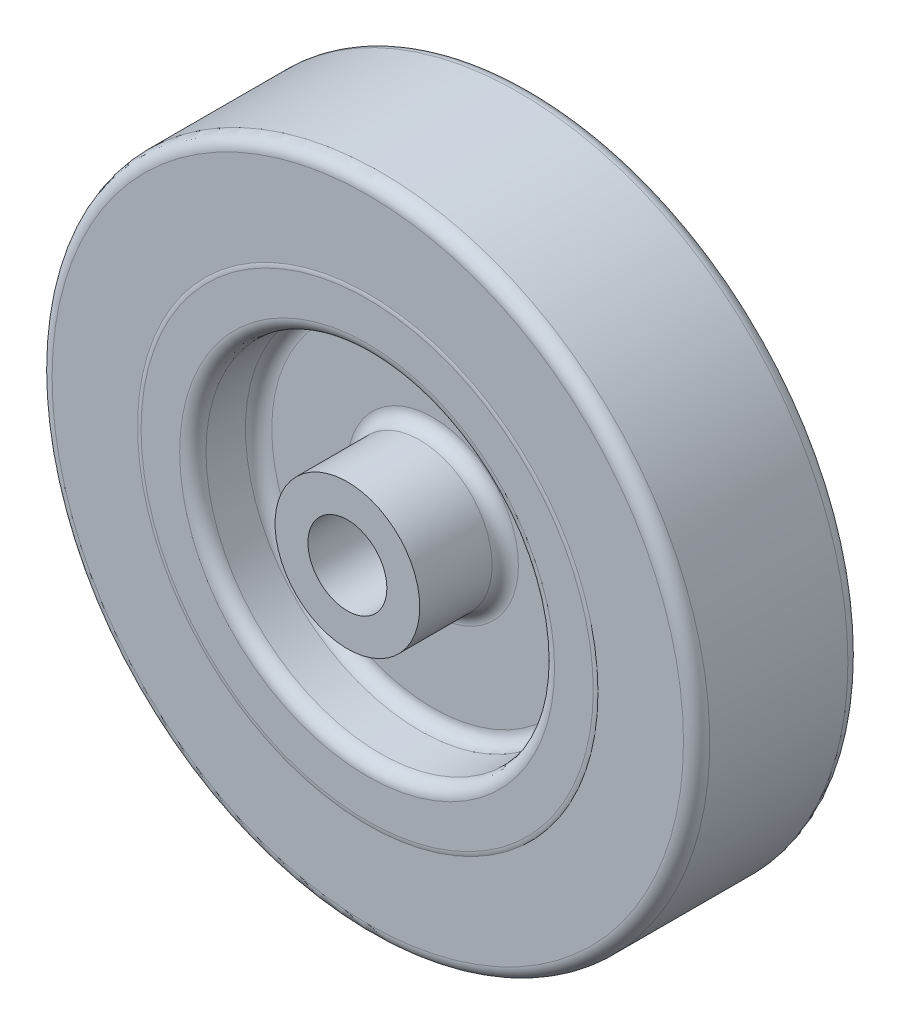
ISO-10303-21;
HEADER;
FILE_DESCRIPTION(('STEP AP214'),'2;1');
FILE_NAME('part.step','',(''),(''),'','','');
FILE_SCHEMA(('AUTOMOTIVE_DESIGN { 1 0 10303 214 1 1 1 1 }'));
ENDSEC;
DATA;
#1=APPLICATION_CONTEXT('core data for automotive mechanical design processes');
#2=APPLICATION_PROTOCOL_DEFINITION('international standard','automotive_design',2000,#1);
#3=PRODUCT_CONTEXT('',#1,'mechanical');
#4=PRODUCT('Part','Part','',(#3));
#5=PRODUCT_RELATED_PRODUCT_CATEGORY('part','',(#4));
#6=PRODUCT_DEFINITION_FORMATION('','',#4);
#7=PRODUCT_DEFINITION_CONTEXT('part definition',#1,'design');
#8=PRODUCT_DEFINITION('design','',#6,#7);
#9=PRODUCT_DEFINITION_SHAPE('','',#8);
#10=(LENGTH_UNIT() NAMED_UNIT(*) SI_UNIT(.MILLI.,.METRE.));
#11=(NAMED_UNIT(*) PLANE_ANGLE_UNIT() SI_UNIT($,.RADIAN.));
#12=(NAMED_UNIT(*) SI_UNIT($,.STERADIAN.) SOLID_ANGLE_UNIT());
#13=UNCERTAINTY_MEASURE_WITH_UNIT(LENGTH_MEASURE(1.E-05),#10,'distance_accuracy_value','');
#14=(GEOMETRIC_REPRESENTATION_CONTEXT(3) GLOBAL_UNCERTAINTY_ASSIGNED_CONTEXT((#13)) GLOBAL_UNIT_ASSIGNED_CONTEXT((#10,
#11,#12)) REPRESENTATION_CONTEXT('',''));
#15=CARTESIAN_POINT('',(0.,0.,0.));
#16=DIRECTION('',(0.,0.,1.));
#17=DIRECTION('',(1.,0.,0.));
#18=AXIS2_PLACEMENT_3D('',#15,#16,#17);
#19=CARTESIAN_POINT('',(-22.1248595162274,15.8933445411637,-3.1));
#20=DIRECTION('',(0.,0.,1.));
#21=DIRECTION('',(1.,0.,0.));
#22=AXIS2_PLACEMENT_3D('',#19,#20,#21);
#23=CYLINDRICAL_SURFACE('',#22,11.);
#24=CARTESIAN_POINT('',(-22.1248595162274,15.8933445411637,17.1));
#25=DIRECTION('',(0.,0.,1.));
#26=DIRECTION('',(1.,0.,0.));
#27=AXIS2_PLACEMENT_3D('',#24,#25,#26);
#28=CIRCLE('',#27,11.);
#29=CARTESIAN_POINT('',(-11.1248595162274,15.8933445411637,17.1));
#30=VERTEX_POINT('',#29);
#31=EDGE_CURVE('E185',#30,#30,#28,.T.);
#32=ORIENTED_EDGE('',*,*,#31,.T.);
#33=EDGE_LOOP('',(#32));
#34=FACE_BOUND('',#33,.T.);
#35=CARTESIAN_POINT('',(-22.1248595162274,15.8933445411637,28.1));
#36=DIRECTION('',(0.,0.,1.));
#37=DIRECTION('',(1.,0.,0.));
#38=AXIS2_PLACEMENT_3D('',#35,#36,#37);
#39=CIRCLE('',#38,11.);
#40=CARTESIAN_POINT('',(-11.1248595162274,15.8933445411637,28.1));
#41=VERTEX_POINT('',#40);
#42=EDGE_CURVE('E99',#41,#41,#39,.T.);
#43=ORIENTED_EDGE('',*,*,#42,.F.);
#44=EDGE_LOOP('',(#43));
#45=FACE_BOUND('',#44,.T.);
#46=ADVANCED_FACE('F16',(#34,#45),#23,.T.);
#47=CARTESIAN_POINT('',(-22.1248595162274,15.8933445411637,17.1));
#48=DIRECTION('',(0.,0.,1.));
#49=DIRECTION('',(1.,0.,0.));
#50=AXIS2_PLACEMENT_3D('',#47,#48,#49);
#51=TOROIDAL_SURFACE('',#50,13.,2.);
#52=ORIENTED_EDGE('',*,*,#31,.F.);
#53=EDGE_LOOP('',(#52));
#54=FACE_BOUND('',#53,.T.);
#55=CARTESIAN_POINT('',(-22.1248595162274,15.8933445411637,15.1));
#56=DIRECTION('',(0.,0.,1.));
#57=DIRECTION('',(-1.,0.,0.));
#58=AXIS2_PLACEMENT_3D('',#55,#56,#57);
#59=CIRCLE('',#58,13.);
#60=CARTESIAN_POINT('',(-9.12485951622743,15.8933445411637,15.1));
#61=VERTEX_POINT('',#60);
#62=CARTESIAN_POINT('',(-35.1248595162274,15.8933445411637,15.1));
#63=VERTEX_POINT('',#62);
#64=EDGE_CURVE('E87',#61,#63,#59,.F.);
#65=ORIENTED_EDGE('',*,*,#64,.F.);
#66=CARTESIAN_POINT('',(-22.1248595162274,15.8933445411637,15.1));
#67=DIRECTION('',(0.,0.,1.));
#68=DIRECTION('',(1.,0.,0.));
#69=AXIS2_PLACEMENT_3D('',#66,#67,#68);
#70=CIRCLE('',#69,13.);
#71=EDGE_CURVE('E90',#63,#61,#70,.F.);
#72=ORIENTED_EDGE('',*,*,#71,.F.);
#73=EDGE_LOOP('',(#65,#72));
#74=FACE_BOUND('',#73,.T.);
#75=ADVANCED_FACE('F98',(#54,#74),#51,.F.);
#76=CARTESIAN_POINT('',(-22.1248595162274,15.8933445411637,28.1));
#77=DIRECTION('',(0.,0.,1.));
#78=DIRECTION('',(1.,0.,0.));
#79=AXIS2_PLACEMENT_3D('',#76,#77,#78);
#80=PLANE('',#79);
#81=ORIENTED_EDGE('',*,*,#42,.T.);
#82=EDGE_LOOP('',(#81));
#83=FACE_BOUND('',#82,.T.);
#84=CARTESIAN_POINT('',(-22.1248595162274,15.8933445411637,28.1));
#85=DIRECTION('',(0.,0.,1.));
#86=DIRECTION('',(1.,0.,0.));
#87=AXIS2_PLACEMENT_3D('',#84,#85,#86);
#88=CIRCLE('',#87,6.);
#89=CARTESIAN_POINT('',(-16.1248595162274,15.8933445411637,28.1));
#90=VERTEX_POINT('',#89);
#91=EDGE_CURVE('E95',#90,#90,#88,.F.);
#92=ORIENTED_EDGE('',*,*,#91,.T.);
#93=EDGE_LOOP('',(#92));
#94=FACE_BOUND('',#93,.T.);
#95=ADVANCED_FACE('F138',(#83,#94),#80,.T.);
#96=CARTESIAN_POINT('',(-22.1248595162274,15.1131894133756,15.1));
#97=DIRECTION('',(0.,0.,1.));
#98=DIRECTION('',(1.,0.,0.));
#99=AXIS2_PLACEMENT_3D('',#96,#97,#98);
#100=PLANE('',#99);
#101=CARTESIAN_POINT('',(-22.1248595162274,15.1131894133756,15.1));
#102=DIRECTION('',(0.,0.,-1.));
#103=DIRECTION('',(-1.,0.,0.));
#104=AXIS2_PLACEMENT_3D('',#101,#102,#103);
#105=CIRCLE('',#104,24.5);
#106=CARTESIAN_POINT('',(2.37514048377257,15.1131894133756,15.1));
#107=VERTEX_POINT('',#106);
#108=CARTESIAN_POINT('',(-46.6248595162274,15.1131894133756,15.1));
#109=VERTEX_POINT('',#108);
#110=EDGE_CURVE('E167',#107,#109,#105,.F.);
#111=ORIENTED_EDGE('',*,*,#110,.T.);
#112=CARTESIAN_POINT('',(-22.1248595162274,15.1131894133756,15.1));
#113=DIRECTION('',(0.,0.,-1.));
#114=DIRECTION('',(1.,0.,0.));
#115=AXIS2_PLACEMENT_3D('',#112,#113,#114);
#116=CIRCLE('',#115,24.5);
#117=EDGE_CURVE('E157',#109,#107,#116,.F.);
#118=ORIENTED_EDGE('',*,*,#117,.T.);
#119=EDGE_LOOP('',(#111,#118));
#120=FACE_BOUND('',#119,.T.);
#121=ORIENTED_EDGE('',*,*,#64,.T.);
#122=ORIENTED_EDGE('',*,*,#71,.T.);
#123=EDGE_LOOP('',(#121,#122));
#124=FACE_BOUND('',#123,.T.);
#125=ADVANCED_FACE('F92',(#120,#124),#100,.T.);
#126=CARTESIAN_POINT('',(-22.1248595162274,15.8933445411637,-12.9));
#127=DIRECTION('',(0.,0.,1.));
#128=DIRECTION('',(1.,0.,0.));
#129=AXIS2_PLACEMENT_3D('',#126,#127,#128);
#130=CYLINDRICAL_SURFACE('',#129,6.);
#131=CARTESIAN_POINT('',(-22.1248595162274,15.8933445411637,-3.1));
#132=DIRECTION('',(0.,0.,1.));
#133=DIRECTION('',(1.,0.,0.));
#134=AXIS2_PLACEMENT_3D('',#131,#132,#133);
#135=CIRCLE('',#134,6.);
#136=CARTESIAN_POINT('',(-16.1248595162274,15.8933445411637,-3.1));
#137=VERTEX_POINT('',#136);
#138=EDGE_CURVE('E202',#137,#137,#135,.F.);
#139=ORIENTED_EDGE('',*,*,#138,.T.);
#140=EDGE_LOOP('',(#139));
#141=FACE_BOUND('',#140,.T.);
#142=ORIENTED_EDGE('',*,*,#91,.F.);
#143=EDGE_LOOP('',(#142));
#144=FACE_BOUND('',#143,.T.);
#145=ADVANCED_FACE('F118',(#141,#144),#130,.F.);
#146=CARTESIAN_POINT('',(-22.1248595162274,15.1131894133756,17.1));
#147=DIRECTION('',(0.,0.,1.));
#148=DIRECTION('',(1.,0.,0.));
#149=AXIS2_PLACEMENT_3D('',#146,#147,#148);
#150=TOROIDAL_SURFACE('',#149,24.5,2.);
#151=ORIENTED_EDGE('',*,*,#110,.F.);
#152=ORIENTED_EDGE('',*,*,#117,.F.);
#153=EDGE_LOOP('',(#151,#152));
#154=FACE_BOUND('',#153,.T.);
#155=CARTESIAN_POINT('',(-22.1248595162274,15.1131894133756,17.1));
#156=DIRECTION('',(0.,0.,1.));
#157=DIRECTION('',(1.,0.,0.));
#158=AXIS2_PLACEMENT_3D('',#155,#156,#157);
#159=CIRCLE('',#158,26.5);
#160=CARTESIAN_POINT('',(4.37514048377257,15.1131894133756,17.1));
#161=VERTEX_POINT('',#160);
#162=EDGE_CURVE('E126',#161,#161,#159,.T.);
#163=ORIENTED_EDGE('',*,*,#162,.T.);
#164=EDGE_LOOP('',(#163));
#165=FACE_BOUND('',#164,.T.);
#166=ADVANCED_FACE('F106',(#154,#165),#150,.F.);
#167=CARTESIAN_POINT('',(-22.1248595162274,15.8933445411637,-3.1));
#168=DIRECTION('',(0.,0.,1.));
#169=DIRECTION('',(1.,0.,0.));
#170=AXIS2_PLACEMENT_3D('',#167,#168,#169);
#171=PLANE('',#170);
#172=CARTESIAN_POINT('',(-22.1248595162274,15.8933445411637,-3.1));
#173=DIRECTION('',(0.,0.,1.));
#174=DIRECTION('',(1.,0.,0.));
#175=AXIS2_PLACEMENT_3D('',#172,#173,#174);
#176=CIRCLE('',#175,11.);
#177=CARTESIAN_POINT('',(-11.1248595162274,15.8933445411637,-3.1));
#178=VERTEX_POINT('',#177);
#179=EDGE_CURVE('E198',#178,#178,#176,.T.);
#180=ORIENTED_EDGE('',*,*,#179,.F.);
#181=EDGE_LOOP('',(#180));
#182=FACE_BOUND('',#181,.T.);
#183=ORIENTED_EDGE('',*,*,#138,.F.);
#184=EDGE_LOOP('',(#183));
#185=FACE_BOUND('',#184,.T.);
#186=ADVANCED_FACE('F117',(#182,#185),#171,.F.);
#187=CARTESIAN_POINT('',(-22.1248595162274,15.1131894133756,15.1));
#188=DIRECTION('',(0.,0.,1.));
#189=DIRECTION('',(1.,0.,0.));
#190=AXIS2_PLACEMENT_3D('',#187,#188,#189);
#191=CYLINDRICAL_SURFACE('',#190,26.5);
#192=ORIENTED_EDGE('',*,*,#162,.F.);
#193=EDGE_LOOP('',(#192));
#194=FACE_BOUND('',#193,.T.);
#195=CARTESIAN_POINT('',(-22.1248595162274,15.1131894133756,23.1));
#196=DIRECTION('',(0.,0.,-1.));
#197=DIRECTION('',(-1.,0.,0.));
#198=AXIS2_PLACEMENT_3D('',#195,#196,#197);
#199=CIRCLE('',#198,26.5);
#200=CARTESIAN_POINT('',(-48.6248595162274,15.1131894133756,23.1));
#201=VERTEX_POINT('',#200);
#202=EDGE_CURVE('E201',#201,#201,#199,.T.);
#203=ORIENTED_EDGE('',*,*,#202,.F.);
#204=EDGE_LOOP('',(#203));
#205=FACE_BOUND('',#204,.T.);
#206=ADVANCED_FACE('F548',(#194,#205),#191,.F.);
#207=CARTESIAN_POINT('',(-22.1248595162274,15.8933445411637,-3.1));
#208=DIRECTION('',(0.,0.,1.));
#209=DIRECTION('',(1.,0.,0.));
#210=AXIS2_PLACEMENT_3D('',#207,#208,#209);
#211=CYLINDRICAL_SURFACE('',#210,11.);
#212=CARTESIAN_POINT('',(-22.1248595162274,15.8933445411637,7.9));
#213=DIRECTION('',(0.,0.,-1.));
#214=DIRECTION('',(-1.,0.,0.));
#215=AXIS2_PLACEMENT_3D('',#212,#213,#214);
#216=CIRCLE('',#215,11.);
#217=CARTESIAN_POINT('',(-33.1248595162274,15.8933445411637,7.9));
#218=VERTEX_POINT('',#217);
#219=EDGE_CURVE('E531',#218,#218,#216,.T.);
#220=ORIENTED_EDGE('',*,*,#219,.T.);
#221=EDGE_LOOP('',(#220));
#222=FACE_BOUND('',#221,.T.);
#223=ORIENTED_EDGE('',*,*,#179,.T.);
#224=EDGE_LOOP('',(#223));
#225=FACE_BOUND('',#224,.T.);
#226=ADVANCED_FACE('F550',(#222,#225),#211,.T.);
#227=CARTESIAN_POINT('',(-22.1248595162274,15.1131894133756,23.1));
#228=DIRECTION('',(0.,0.,-1.));
#229=DIRECTION('',(-1.,0.,0.));
#230=AXIS2_PLACEMENT_3D('',#227,#228,#229);
#231=TOROIDAL_SURFACE('',#230,28.5,2.);
#232=CARTESIAN_POINT('',(-22.1248595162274,15.1131894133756,25.1));
#233=DIRECTION('',(0.,0.,1.));
#234=DIRECTION('',(-1.,0.,0.));
#235=AXIS2_PLACEMENT_3D('',#232,#233,#234);
#236=CIRCLE('',#235,28.5);
#237=CARTESIAN_POINT('',(-50.6248595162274,15.1131894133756,25.1));
#238=VERTEX_POINT('',#237);
#239=CARTESIAN_POINT('',(6.37514048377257,15.1131894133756,25.1));
#240=VERTEX_POINT('',#239);
#241=EDGE_CURVE('E466',#238,#240,#236,.T.);
#242=ORIENTED_EDGE('',*,*,#241,.T.);
#243=CARTESIAN_POINT('',(-22.1248595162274,15.1131894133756,25.1));
#244=DIRECTION('',(0.,0.,1.));
#245=DIRECTION('',(1.,0.,0.));
#246=AXIS2_PLACEMENT_3D('',#243,#244,#245);
#247=CIRCLE('',#246,28.5);
#248=EDGE_CURVE('E477',#240,#238,#247,.T.);
#249=ORIENTED_EDGE('',*,*,#248,.T.);
#250=EDGE_LOOP('',(#242,#249));
#251=FACE_BOUND('',#250,.T.);
#252=ORIENTED_EDGE('',*,*,#202,.T.);
#253=EDGE_LOOP('',(#252));
#254=FACE_BOUND('',#253,.T.);
#255=ADVANCED_FACE('F503',(#251,#254),#231,.T.);
#256=CARTESIAN_POINT('',(-22.1248595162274,15.8933445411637,7.9));
#257=DIRECTION('',(0.,0.,-1.));
#258=DIRECTION('',(-1.,0.,0.));
#259=AXIS2_PLACEMENT_3D('',#256,#257,#258);
#260=TOROIDAL_SURFACE('',#259,13.,2.);
#261=ORIENTED_EDGE('',*,*,#219,.F.);
#262=EDGE_LOOP('',(#261));
#263=FACE_BOUND('',#262,.T.);
#264=CARTESIAN_POINT('',(-22.1248595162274,15.8933445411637,9.9));
#265=DIRECTION('',(0.,0.,-1.));
#266=DIRECTION('',(1.,0.,0.));
#267=AXIS2_PLACEMENT_3D('',#264,#265,#266);
#268=CIRCLE('',#267,13.);
#269=CARTESIAN_POINT('',(-35.1248595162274,15.8933445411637,9.9));
#270=VERTEX_POINT('',#269);
#271=CARTESIAN_POINT('',(-9.12485951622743,15.8933445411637,9.9));
#272=VERTEX_POINT('',#271);
#273=EDGE_CURVE('E389',#270,#272,#268,.F.);
#274=ORIENTED_EDGE('',*,*,#273,.F.);
#275=CARTESIAN_POINT('',(-22.1248595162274,15.8933445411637,9.9));
#276=DIRECTION('',(0.,0.,-1.));
#277=DIRECTION('',(-1.,0.,0.));
#278=AXIS2_PLACEMENT_3D('',#275,#276,#277);
#279=CIRCLE('',#278,13.);
#280=EDGE_CURVE('E640',#272,#270,#279,.F.);
#281=ORIENTED_EDGE('',*,*,#280,.F.);
#282=EDGE_LOOP('',(#274,#281));
#283=FACE_BOUND('',#282,.T.);
#284=ADVANCED_FACE('F499',(#263,#283),#260,.F.);
#285=CARTESIAN_POINT('',(-22.1248595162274,15.1131894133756,25.1));
#286=DIRECTION('',(0.,0.,-1.));
#287=DIRECTION('',(-1.,0.,0.));
#288=AXIS2_PLACEMENT_3D('',#285,#286,#287);
#289=PLANE('',#288);
#290=ORIENTED_EDGE('',*,*,#241,.F.);
#291=ORIENTED_EDGE('',*,*,#248,.F.);
#292=EDGE_LOOP('',(#290,#291));
#293=FACE_BOUND('',#292,.T.);
#294=CARTESIAN_POINT('',(-22.1248595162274,15.1131894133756,25.1));
#295=DIRECTION('',(0.,0.,-1.));
#296=DIRECTION('',(1.,0.,0.));
#297=AXIS2_PLACEMENT_3D('',#294,#295,#296);
#298=CIRCLE('',#297,34.3755002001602);
#299=CARTESIAN_POINT('',(12.2506406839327,15.1131894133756,25.1));
#300=VERTEX_POINT('',#299);
#301=CARTESIAN_POINT('',(-56.5003597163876,15.1131894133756,25.1));
#302=VERTEX_POINT('',#301);
#303=EDGE_CURVE('E444',#300,#302,#298,.T.);
#304=ORIENTED_EDGE('',*,*,#303,.F.);
#305=CARTESIAN_POINT('',(-22.1248595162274,15.1131894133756,25.1));
#306=DIRECTION('',(0.,0.,-1.));
#307=DIRECTION('',(-1.,0.,0.));
#308=AXIS2_PLACEMENT_3D('',#305,#306,#307);
#309=CIRCLE('',#308,34.3755002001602);
#310=EDGE_CURVE('E454',#302,#300,#309,.T.);
#311=ORIENTED_EDGE('',*,*,#310,.F.);
#312=EDGE_LOOP('',(#304,#311));
#313=FACE_BOUND('',#312,.T.);
#314=ADVANCED_FACE('F404',(#293,#313),#289,.F.);
#315=CARTESIAN_POINT('',(-22.1248595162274,15.1131894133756,9.9));
#316=DIRECTION('',(0.,0.,-1.));
#317=DIRECTION('',(-1.,0.,0.));
#318=AXIS2_PLACEMENT_3D('',#315,#316,#317);
#319=PLANE('',#318);
#320=CARTESIAN_POINT('',(-22.1248595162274,15.1131894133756,9.9));
#321=DIRECTION('',(0.,0.,1.));
#322=DIRECTION('',(1.,0.,0.));
#323=AXIS2_PLACEMENT_3D('',#320,#321,#322);
#324=CIRCLE('',#323,24.5);
#325=CARTESIAN_POINT('',(-46.6248595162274,15.1131894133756,9.9));
#326=VERTEX_POINT('',#325);
#327=CARTESIAN_POINT('',(2.37514048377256,15.1131894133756,9.9));
#328=VERTEX_POINT('',#327);
#329=EDGE_CURVE('E197',#326,#328,#324,.F.);
#330=ORIENTED_EDGE('',*,*,#329,.T.);
#331=CARTESIAN_POINT('',(-22.1248595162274,15.1131894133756,9.9));
#332=DIRECTION('',(0.,0.,1.));
#333=DIRECTION('',(-1.,0.,0.));
#334=AXIS2_PLACEMENT_3D('',#331,#332,#333);
#335=CIRCLE('',#334,24.5);
#336=EDGE_CURVE('E355',#328,#326,#335,.F.);
#337=ORIENTED_EDGE('',*,*,#336,.T.);
#338=EDGE_LOOP('',(#330,#337));
#339=FACE_BOUND('',#338,.T.);
#340=ORIENTED_EDGE('',*,*,#273,.T.);
#341=ORIENTED_EDGE('',*,*,#280,.T.);
#342=EDGE_LOOP('',(#340,#341));
#343=FACE_BOUND('',#342,.T.);
#344=ADVANCED_FACE('F395',(#339,#343),#319,.T.);
#345=CARTESIAN_POINT('',(-22.1248595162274,15.1131894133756,23.1));
#346=DIRECTION('',(0.,0.,1.));
#347=DIRECTION('',(1.,0.,0.));
#348=AXIS2_PLACEMENT_3D('',#345,#346,#347);
#349=TOROIDAL_SURFACE('',#348,34.3755002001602,2.);
#350=ORIENTED_EDGE('',*,*,#303,.T.);
#351=ORIENTED_EDGE('',*,*,#310,.T.);
#352=EDGE_LOOP('',(#350,#351));
#353=FACE_BOUND('',#352,.T.);
#354=CARTESIAN_POINT('',(-22.1248595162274,15.1131894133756,25.));
#355=DIRECTION('',(0.,0.,1.));
#356=DIRECTION('',(1.,0.,0.));
#357=AXIS2_PLACEMENT_3D('',#354,#355,#356);
#358=CIRCLE('',#357,35.);
#359=CARTESIAN_POINT('',(12.8751404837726,15.1131894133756,25.));
#360=VERTEX_POINT('',#359);
#361=EDGE_CURVE('E193',#360,#360,#358,.F.);
#362=ORIENTED_EDGE('',*,*,#361,.F.);
#363=EDGE_LOOP('',(#362));
#364=FACE_BOUND('',#363,.T.);
#365=ADVANCED_FACE('F374',(#353,#364),#349,.T.);
#366=CARTESIAN_POINT('',(-22.1248595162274,15.1131894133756,7.9));
#367=DIRECTION('',(0.,0.,-1.));
#368=DIRECTION('',(-1.,0.,0.));
#369=AXIS2_PLACEMENT_3D('',#366,#367,#368);
#370=TOROIDAL_SURFACE('',#369,24.5,2.);
#371=ORIENTED_EDGE('',*,*,#329,.F.);
#372=ORIENTED_EDGE('',*,*,#336,.F.);
#373=EDGE_LOOP('',(#371,#372));
#374=FACE_BOUND('',#373,.T.);
#375=CARTESIAN_POINT('',(-22.1248595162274,15.1131894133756,7.9));
#376=DIRECTION('',(0.,0.,-1.));
#377=DIRECTION('',(-1.,0.,0.));
#378=AXIS2_PLACEMENT_3D('',#375,#376,#377);
#379=CIRCLE('',#378,26.5);
#380=CARTESIAN_POINT('',(-48.6248595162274,15.1131894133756,7.9));
#381=VERTEX_POINT('',#380);
#382=EDGE_CURVE('E196',#381,#381,#379,.T.);
#383=ORIENTED_EDGE('',*,*,#382,.T.);
#384=EDGE_LOOP('',(#383));
#385=FACE_BOUND('',#384,.T.);
#386=ADVANCED_FACE('F362',(#374,#385),#370,.F.);
#387=CARTESIAN_POINT('',(-22.1248595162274,15.1131894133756,25.));
#388=DIRECTION('',(0.,0.,1.));
#389=DIRECTION('',(1.,0.,0.));
#390=AXIS2_PLACEMENT_3D('',#387,#388,#389);
#391=PLANE('',#390);
#392=ORIENTED_EDGE('',*,*,#361,.T.);
#393=EDGE_LOOP('',(#392));
#394=FACE_BOUND('',#393,.T.);
#395=CARTESIAN_POINT('',(-22.1248595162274,15.1131894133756,25.));
#396=DIRECTION('',(0.,0.,-1.));
#397=DIRECTION('',(-1.,0.,0.));
#398=AXIS2_PLACEMENT_3D('',#395,#396,#397);
#399=CIRCLE('',#398,48.);
#400=CARTESIAN_POINT('',(-70.1248595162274,15.1131894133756,25.));
#401=VERTEX_POINT('',#400);
#402=CARTESIAN_POINT('',(25.8751404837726,15.1131894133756,25.));
#403=VERTEX_POINT('',#402);
#404=EDGE_CURVE('E342',#401,#403,#399,.T.);
#405=ORIENTED_EDGE('',*,*,#404,.F.);
#406=CARTESIAN_POINT('',(-22.1248595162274,15.1131894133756,25.));
#407=DIRECTION('',(0.,0.,-1.));
#408=DIRECTION('',(1.,0.,0.));
#409=AXIS2_PLACEMENT_3D('',#406,#407,#408);
#410=CIRCLE('',#409,48.);
#411=EDGE_CURVE('E589',#403,#401,#410,.T.);
#412=ORIENTED_EDGE('',*,*,#411,.F.);
#413=EDGE_LOOP('',(#405,#412));
#414=FACE_BOUND('',#413,.T.);
#415=ADVANCED_FACE('F373',(#394,#414),#391,.T.);
#416=CARTESIAN_POINT('',(-22.1248595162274,15.1131894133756,9.9));
#417=DIRECTION('',(0.,0.,-1.));
#418=DIRECTION('',(-1.,0.,0.));
#419=AXIS2_PLACEMENT_3D('',#416,#417,#418);
#420=CYLINDRICAL_SURFACE('',#419,26.5);
#421=ORIENTED_EDGE('',*,*,#382,.F.);
#422=EDGE_LOOP('',(#421));
#423=FACE_BOUND('',#422,.T.);
#424=CARTESIAN_POINT('',(-22.1248595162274,15.1131894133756,1.9));
#425=DIRECTION('',(0.,0.,-1.));
#426=DIRECTION('',(-1.,0.,0.));
#427=AXIS2_PLACEMENT_3D('',#424,#425,#426);
#428=CIRCLE('',#427,26.5);
#429=CARTESIAN_POINT('',(-48.6248595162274,15.1131894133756,1.9));
#430=VERTEX_POINT('',#429);
#431=EDGE_CURVE('E587',#430,#430,#428,.F.);
#432=ORIENTED_EDGE('',*,*,#431,.F.);
#433=EDGE_LOOP('',(#432));
#434=FACE_BOUND('',#433,.T.);
#435=ADVANCED_FACE('F623',(#423,#434),#420,.F.);
#436=CARTESIAN_POINT('',(-22.1248595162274,15.1131894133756,23.));
#437=DIRECTION('',(0.,0.,1.));
#438=DIRECTION('',(1.,0.,0.));
#439=AXIS2_PLACEMENT_3D('',#436,#437,#438);
#440=TOROIDAL_SURFACE('',#439,48.,2.);
#441=CARTESIAN_POINT('',(-22.1248595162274,15.1131894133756,23.));
#442=DIRECTION('',(0.,0.,-1.));
#443=DIRECTION('',(-1.,0.,0.));
#444=AXIS2_PLACEMENT_3D('',#441,#442,#443);
#445=CIRCLE('',#444,50.);
#446=CARTESIAN_POINT('',(-72.1248595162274,15.1131894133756,23.));
#447=VERTEX_POINT('',#446);
#448=EDGE_CURVE('E584',#447,#447,#445,.T.);
#449=ORIENTED_EDGE('',*,*,#448,.F.);
#450=EDGE_LOOP('',(#449));
#451=FACE_BOUND('',#450,.T.);
#452=ORIENTED_EDGE('',*,*,#411,.T.);
#453=ORIENTED_EDGE('',*,*,#404,.T.);
#454=EDGE_LOOP('',(#452,#453));
#455=FACE_BOUND('',#454,.T.);
#456=ADVANCED_FACE('F320',(#451,#455),#440,.T.);
#457=CARTESIAN_POINT('',(-22.1248595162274,15.1131894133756,1.9));
#458=DIRECTION('',(0.,0.,-1.));
#459=DIRECTION('',(-1.,0.,0.));
#460=AXIS2_PLACEMENT_3D('',#457,#458,#459);
#461=TOROIDAL_SURFACE('',#460,28.5,2.);
#462=ORIENTED_EDGE('',*,*,#431,.T.);
#463=EDGE_LOOP('',(#462));
#464=FACE_BOUND('',#463,.T.);
#465=CARTESIAN_POINT('',(-22.1248595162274,15.1131894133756,-0.0999999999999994));
#466=DIRECTION('',(0.,0.,-1.));
#467=DIRECTION('',(-1.,0.,0.));
#468=AXIS2_PLACEMENT_3D('',#465,#466,#467);
#469=CIRCLE('',#468,28.5);
#470=CARTESIAN_POINT('',(6.37514048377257,15.1131894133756,-0.0999999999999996));
#471=VERTEX_POINT('',#470);
#472=CARTESIAN_POINT('',(-50.6248595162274,15.1131894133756,-0.0999999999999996));
#473=VERTEX_POINT('',#472);
#474=EDGE_CURVE('E292',#471,#473,#469,.F.);
#475=ORIENTED_EDGE('',*,*,#474,.F.);
#476=CARTESIAN_POINT('',(-22.1248595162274,15.1131894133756,-0.0999999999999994));
#477=DIRECTION('',(0.,0.,-1.));
#478=DIRECTION('',(1.,0.,0.));
#479=AXIS2_PLACEMENT_3D('',#476,#477,#478);
#480=CIRCLE('',#479,28.5);
#481=EDGE_CURVE('E586',#473,#471,#480,.F.);
#482=ORIENTED_EDGE('',*,*,#481,.F.);
#483=EDGE_LOOP('',(#475,#482));
#484=FACE_BOUND('',#483,.T.);
#485=ADVANCED_FACE('F316',(#464,#484),#461,.T.);
#486=CARTESIAN_POINT('',(-22.1248595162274,15.1131894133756,25.));
#487=DIRECTION('',(0.,0.,-1.));
#488=DIRECTION('',(-1.,0.,0.));
#489=AXIS2_PLACEMENT_3D('',#486,#487,#488);
#490=CYLINDRICAL_SURFACE('',#489,50.);
#491=ORIENTED_EDGE('',*,*,#448,.T.);
#492=EDGE_LOOP('',(#491));
#493=FACE_BOUND('',#492,.T.);
#494=CARTESIAN_POINT('',(-22.1248595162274,15.1131894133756,2.));
#495=DIRECTION('',(0.,0.,1.));
#496=DIRECTION('',(1.,0.,0.));
#497=AXIS2_PLACEMENT_3D('',#494,#495,#496);
#498=CIRCLE('',#497,50.);
#499=CARTESIAN_POINT('',(27.8751404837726,15.1131894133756,2.));
#500=VERTEX_POINT('',#499);
#501=EDGE_CURVE('E305',#500,#500,#498,.F.);
#502=ORIENTED_EDGE('',*,*,#501,.F.);
#503=EDGE_LOOP('',(#502));
#504=FACE_BOUND('',#503,.T.);
#505=ADVANCED_FACE('F272',(#493,#504),#490,.T.);
#506=CARTESIAN_POINT('',(-22.1248595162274,15.1131894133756,-0.1));
#507=DIRECTION('',(0.,0.,-1.));
#508=DIRECTION('',(-1.,0.,0.));
#509=AXIS2_PLACEMENT_3D('',#506,#507,#508);
#510=PLANE('',#509);
#511=ORIENTED_EDGE('',*,*,#481,.T.);
#512=ORIENTED_EDGE('',*,*,#474,.T.);
#513=EDGE_LOOP('',(#511,#512));
#514=FACE_BOUND('',#513,.T.);
#515=CARTESIAN_POINT('',(-22.1248595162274,15.1131894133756,-0.1));
#516=DIRECTION('',(0.,0.,1.));
#517=DIRECTION('',(-1.,0.,0.));
#518=AXIS2_PLACEMENT_3D('',#515,#516,#517);
#519=CIRCLE('',#518,34.3755002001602);
#520=CARTESIAN_POINT('',(-56.5003597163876,15.1131894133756,-0.1));
#521=VERTEX_POINT('',#520);
#522=CARTESIAN_POINT('',(12.2506406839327,15.1131894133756,-0.1));
#523=VERTEX_POINT('',#522);
#524=EDGE_CURVE('E258',#521,#523,#519,.T.);
#525=ORIENTED_EDGE('',*,*,#524,.F.);
#526=CARTESIAN_POINT('',(-22.1248595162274,15.1131894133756,-0.1));
#527=DIRECTION('',(0.,0.,1.));
#528=DIRECTION('',(1.,0.,0.));
#529=AXIS2_PLACEMENT_3D('',#526,#527,#528);
#530=CIRCLE('',#529,34.3755002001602);
#531=EDGE_CURVE('E214',#523,#521,#530,.T.);
#532=ORIENTED_EDGE('',*,*,#531,.F.);
#533=EDGE_LOOP('',(#525,#532));
#534=FACE_BOUND('',#533,.T.);
#535=ADVANCED_FACE('F263',(#514,#534),#510,.T.);
#536=CARTESIAN_POINT('',(-22.1248595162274,15.1131894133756,2.));
#537=DIRECTION('',(0.,0.,1.));
#538=DIRECTION('',(1.,0.,0.));
#539=AXIS2_PLACEMENT_3D('',#536,#537,#538);
#540=TOROIDAL_SURFACE('',#539,48.,2.);
#541=CARTESIAN_POINT('',(-22.1248595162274,15.1131894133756,0.));
#542=DIRECTION('',(0.,0.,1.));
#543=DIRECTION('',(1.,0.,0.));
#544=AXIS2_PLACEMENT_3D('',#541,#542,#543);
#545=CIRCLE('',#544,48.);
#546=CARTESIAN_POINT('',(25.8751404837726,15.1131894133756,0.));
#547=VERTEX_POINT('',#546);
#548=CARTESIAN_POINT('',(-70.1248595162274,15.1131894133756,0.));
#549=VERTEX_POINT('',#548);
#550=EDGE_CURVE('E564',#547,#549,#545,.T.);
#551=ORIENTED_EDGE('',*,*,#550,.T.);
#552=CARTESIAN_POINT('',(-22.1248595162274,15.1131894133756,0.));
#553=DIRECTION('',(0.,0.,1.));
#554=DIRECTION('',(-1.,0.,0.));
#555=AXIS2_PLACEMENT_3D('',#552,#553,#554);
#556=CIRCLE('',#555,48.);
#557=EDGE_CURVE('E26',#549,#547,#556,.T.);
#558=ORIENTED_EDGE('',*,*,#557,.T.);
#559=EDGE_LOOP('',(#551,#558));
#560=FACE_BOUND('',#559,.T.);
#561=ORIENTED_EDGE('',*,*,#501,.T.);
#562=EDGE_LOOP('',(#561));
#563=FACE_BOUND('',#562,.T.);
#564=ADVANCED_FACE('F233',(#560,#563),#540,.T.);
#565=CARTESIAN_POINT('',(-22.1248595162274,15.1131894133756,1.9));
#566=DIRECTION('',(0.,0.,1.));
#567=DIRECTION('',(1.,0.,0.));
#568=AXIS2_PLACEMENT_3D('',#565,#566,#567);
#569=TOROIDAL_SURFACE('',#568,34.3755002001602,2.);
#570=ORIENTED_EDGE('',*,*,#531,.T.);
#571=ORIENTED_EDGE('',*,*,#524,.T.);
#572=EDGE_LOOP('',(#570,#571));
#573=FACE_BOUND('',#572,.T.);
#574=CARTESIAN_POINT('',(-22.1248595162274,15.1131894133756,0.));
#575=DIRECTION('',(0.,0.,1.));
#576=DIRECTION('',(1.,0.,0.));
#577=AXIS2_PLACEMENT_3D('',#574,#575,#576);
#578=CIRCLE('',#577,35.);
#579=CARTESIAN_POINT('',(12.8751404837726,15.1131894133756,0.));
#580=VERTEX_POINT('',#579);
#581=EDGE_CURVE('E11',#580,#580,#578,.F.);
#582=ORIENTED_EDGE('',*,*,#581,.T.);
#583=EDGE_LOOP('',(#582));
#584=FACE_BOUND('',#583,.T.);
#585=ADVANCED_FACE('F221',(#573,#584),#569,.T.);
#586=CARTESIAN_POINT('',(-22.1248595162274,15.1131894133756,0.));
#587=DIRECTION('',(0.,0.,1.));
#588=DIRECTION('',(1.,0.,0.));
#589=AXIS2_PLACEMENT_3D('',#586,#587,#588);
#590=PLANE('',#589);
#591=ORIENTED_EDGE('',*,*,#581,.F.);
#592=EDGE_LOOP('',(#591));
#593=FACE_BOUND('',#592,.T.);
#594=ORIENTED_EDGE('',*,*,#550,.F.);
#595=ORIENTED_EDGE('',*,*,#557,.F.);
#596=EDGE_LOOP('',(#594,#595));
#597=FACE_BOUND('',#596,.T.);
#598=ADVANCED_FACE('F232',(#593,#597),#590,.F.);
#599=CLOSED_SHELL('',(#46,#75,#95,#125,#145,#166,#186,#206,#226,#255,#284,#314,#344,#365,#386,
#415,#435,#456,#485,#505,#535,#564,#585,#598));
#600=MANIFOLD_SOLID_BREP('B1',#599);
#601=ADVANCED_BREP_SHAPE_REPRESENTATION('',(#18,#600),#14);
#602=SHAPE_DEFINITION_REPRESENTATION(#9,#601);
ENDSEC;
END-ISO-10303-21;
